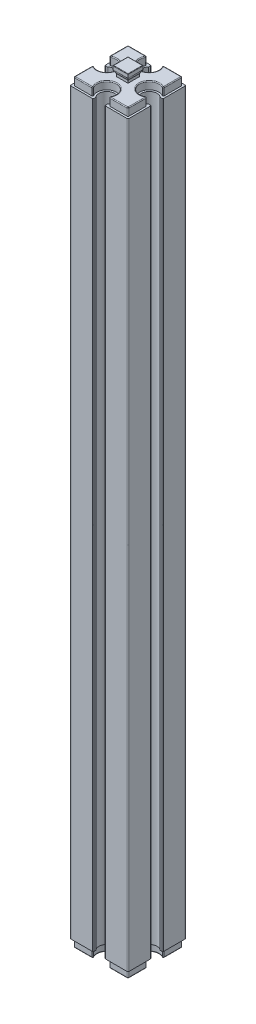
from build123d import *

# Parameters (mm, degrees)
EXTRUDE_1_DEPTH        = 95.5
EXTRUDE_2_DEPTH        = 2
EXTRUDE_3_DEPTH        = 2
FILLET_3_R             = 0.2
CUT_EXTRUDE_1_DEPTH    = 3
FILLET_4_R             = 0.2
FILLET_5_R             = 0.1
FILLET_3_OF_MIRROR_1_R = 0.2
FILLET_4_OF_MIRROR_1_R = 0.2
FILLET_5_OF_MIRROR_1_R = 0.1


with BuildPart() as part:
    # Sketch 1 → Extrude 1 (new body)
    with BuildSketch(Plane(origin=(0, 0, 0), x_dir=(1, 0, 0), z_dir=(0, 1, 0))):
        with BuildLine():
            Line((-7.5, 7.5), (-1.5, 7.5))
            Line((-1.5, 7.5), (-1.5, 6.822875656))
            ThreePointArc((-1.5, 6.822875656), (0, 3.5), (1.5, 6.822875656))
            Line((1.5, 6.822875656), (1.5, 7.5))
            Line((1.5, 7.5), (7.5, 7.5))
            Line((7.5, 7.5), (7.5, 1.5))
            Line((7.5, 1.5), (6.822875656, 1.5))
            ThreePointArc((6.822875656, 1.5), (3.5, 0), (6.822875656, -1.5))
            Line((6.822875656, -1.5), (7.5, -1.5))
            Line((7.5, -1.5), (7.5, -7.5))
            Line((7.5, -7.5), (1.5, -7.5))
            Line((1.5, -7.5), (1.5, -6.822875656))
            ThreePointArc((1.5, -6.822875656), (0, -3.5), (-1.5, -6.822875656))
            Line((-1.5, -6.822875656), (-1.5, -7.5))
            Line((-1.5, -7.5), (-7.5, -7.5))
            Line((-7.5, -7.5), (-7.5, -1.5))
            Line((-7.5, -1.5), (-6.822875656, -1.5))
            ThreePointArc((-6.822875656, -1.5), (-3.5, 0), (-6.822875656, 1.5))
            Line((-6.822875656, 1.5), (-7.5, 1.5))
            Line((-7.5, 1.5), (-7.5, 7.5))
        make_face()
    extrude_1 = extrude(amount=EXTRUDE_1_DEPTH)

    # Sketch 2 → Extrude 2 (add)
    with BuildSketch(Plane(origin=(0, 95.5, 0), x_dir=(1, 0, 0), z_dir=(0, 1, 0))):
        with BuildLine():
            Line((-7, 7), (-7, 2))
            ThreePointArc((-7, 2), (-3, 0), (-7, -2))
            Line((-7, -2), (-7, -7))
            Line((-7, -7), (-2, -7))
            ThreePointArc((-2, -7), (0, -3), (2, -7))
            Line((2, -7), (7, -7))
            Line((7, -7), (7, -2))
            ThreePointArc((7, -2), (3, 0), (7, 2))
            Line((7, 2), (7, 7))
            Line((7, 7), (2, 7))
            ThreePointArc((2, 7), (0, 3), (-2, 7))
            Line((-2, 7), (-7, 7))
        make_face()
    extrude_2 = extrude(amount=EXTRUDE_2_DEPTH)

    # Sketch 3 → Extrude 3 (add, symmetric)
    with BuildSketch(Plane(origin=(0, 0, 0), x_dir=(0, 0, -1), z_dir=(1, 0, 0))):
        with BuildLine():
            Line((-1.5, 97.5), (1.5, 97.5))
            Line((1.5, 97.5), (1.5, 98.177124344))
            ThreePointArc((1.5, 98.177124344), (1.780042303, 98.588161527), (1.95, 99.055590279))
            Line((1.95, 99.055590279), (1.95, 100))
            Line((1.95, 100), (-1.95, 100))
            Line((-1.95, 100), (-1.95, 99.055590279))
            ThreePointArc((-1.95, 99.055590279), (-1.780042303, 98.588161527), (-1.5, 98.177124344))
            Line((-1.5, 98.177124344), (-1.5, 97.5))
        make_face()
    extrude_3 = extrude(amount=EXTRUDE_3_DEPTH, both=True)

    # Fillet 3
    fillet_3_edges = [part.edges().sort_by_distance(p)[0] for p in [
        (-7.5, 47.75, -7.5),
        (-1.5, 47.75, -7.5),
        (1.5, 47.75, -7.5),
        (7.5, 47.75, -7.5),
        (7.5, 47.75, -1.5),
        (7.5, 47.75, 1.5),
        (7.5, 47.75, 7.5),
        (1.5, 47.75, 7.5),
        (-1.5, 47.75, 7.5),
        (-7.5, 47.75, 7.5),
        (-7.5, 47.75, 1.5),
        (-6.822875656, 47.75, -1.5),
        (-7.5, 47.75, -1.5),
    ]]
    fillet(fillet_3_edges, radius=FILLET_3_R)

    # Sketch 4 → Cut-Extrude 1 (cut, symmetric)
    with BuildSketch(Plane.XY):
        with BuildLine():
            Line((1.95, 100), (2, 100))
            Line((2, 100), (2, 97.5))
            Line((2, 97.5), (1.5, 97.5))
            Line((1.5, 97.5), (1.5, 98.177124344))
            ThreePointArc((1.5, 98.177124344), (1.780042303, 98.588161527), (1.95, 99.055590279))
            Line((1.95, 99.055590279), (1.95, 100))
        make_face()
        with BuildLine():
            Line((-1.95, 100), (-1.95, 99.055590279))
            ThreePointArc((-1.95, 99.055590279), (-1.780042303, 98.588161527), (-1.5, 98.177124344))
            Line((-1.5, 98.177124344), (-1.5, 97.5))
            Line((-1.5, 97.5), (-2, 97.5))
            Line((-2, 97.5), (-2, 100))
            Line((-2, 100), (-1.95, 100))
        make_face()
    cut_extrude_1 = extrude(amount=CUT_EXTRUDE_1_DEPTH, both=True, mode=Mode.SUBTRACT)

    # Fillet 4
    fillet_4_edges = [part.edges().sort_by_distance(p)[0] for p in [
        (-2, 96.5, -7),
        (-7, 96.5, -7),
        (-7, 96.5, -2),
        (-7, 96.5, 2),
        (-7, 96.5, 7),
        (-2, 96.5, 7),
        (2, 96.5, 7),
        (7, 96.5, 7),
        (7, 96.5, 2),
        (7, 96.5, -2),
        (7, 96.5, -7),
        (2, 96.5, -7),
        (-4.5, 97.5, -7),
        (-7, 97.5, -4.5),
        (-3, 97.5, 0),
        (-7, 97.5, 4.5),
        (-4.5, 97.5, 7),
        (0, 97.5, 3),
        (4.5, 97.5, 7),
        (7, 97.5, 4.5),
        (3, 97.5, 0),
        (7, 97.5, -4.5),
        (4.5, 97.5, -7),
        (0, 97.5, -3),
    ]]
    fillet(fillet_4_edges, radius=FILLET_4_R)

    # Fillet 5
    fillet_5_edges = [part.edges().sort_by_distance(p)[0] for p in [
        (1.95, 100, 0),
        (0, 100, -1.95),
        (0, 100, 1.95),
        (-1.95, 100, 0),
    ]]
    fillet(fillet_5_edges, radius=FILLET_5_R)

    # Mirror 1: Extrude 1, Extrude 2, Extrude 3, Cut-Extrude 1 across Top Plane
    add(extrude_1.mirror(Plane(origin=(0, 0, 0), x_dir=(1, 0, 0), z_dir=(0, 1, 0))))
    add(extrude_2.mirror(Plane(origin=(0, 0, 0), x_dir=(1, 0, 0), z_dir=(0, 1, 0))))
    add(extrude_3.mirror(Plane(origin=(0, 0, 0), x_dir=(1, 0, 0), z_dir=(0, 1, 0))))
    add(cut_extrude_1.mirror(Plane(origin=(0, 0, 0), x_dir=(1, 0, 0), z_dir=(0, 1, 0))), mode=Mode.SUBTRACT)

    # Fillet 3 of Mirror 1
    fillet_3_of_mirror_1_edges = [part.edges().sort_by_distance(p)[0] for p in [
        (-7.5, -47.75, -7.5),
        (-1.5, -47.75, -7.5),
        (1.5, -47.75, -7.5),
        (7.5, -47.75, -7.5),
        (7.5, -47.75, -1.5),
        (7.5, -47.75, 1.5),
        (7.5, -47.75, 7.5),
        (1.5, -47.75, 7.5),
        (-1.5, -47.75, 7.5),
        (-7.5, -47.75, 7.5),
        (-7.5, -47.75, 1.5),
        (-6.822875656, -47.75, -1.5),
        (-7.5, -47.75, -1.5),
    ]]
    fillet(fillet_3_of_mirror_1_edges, radius=FILLET_3_OF_MIRROR_1_R)

    # Fillet 4 of Mirror 1
    fillet_4_of_mirror_1_edges = [part.edges().sort_by_distance(p)[0] for p in [
        (-2, -96.5, -7),
        (-7, -96.5, -7),
        (-7, -96.5, -2),
        (-7, -96.5, 2),
        (-7, -96.5, 7),
        (-2, -96.5, 7),
        (2, -96.5, 7),
        (7, -96.5, 7),
        (7, -96.5, 2),
        (7, -96.5, -2),
        (7, -96.5, -7),
        (2, -96.5, -7),
        (-4.5, -97.5, -7),
        (-7, -97.5, -4.5),
        (-3, -97.5, 0),
        (-7, -97.5, 4.5),
        (-4.5, -97.5, 7),
        (0, -97.5, 3),
        (4.5, -97.5, 7),
        (7, -97.5, 4.5),
        (3, -97.5, 0),
        (7, -97.5, -4.5),
        (4.5, -97.5, -7),
        (0, -97.5, -3),
    ]]
    fillet(fillet_4_of_mirror_1_edges, radius=FILLET_4_OF_MIRROR_1_R)

    # Fillet 5 of Mirror 1
    fillet_5_of_mirror_1_edges = [part.edges().sort_by_distance(p)[0] for p in [
        (1.95, -100, 0),
        (0, -100, -1.95),
        (0, -100, 1.95),
        (-1.95, -100, 0),
    ]]
    fillet(fillet_5_of_mirror_1_edges, radius=FILLET_5_OF_MIRROR_1_R)


solid = part.part
